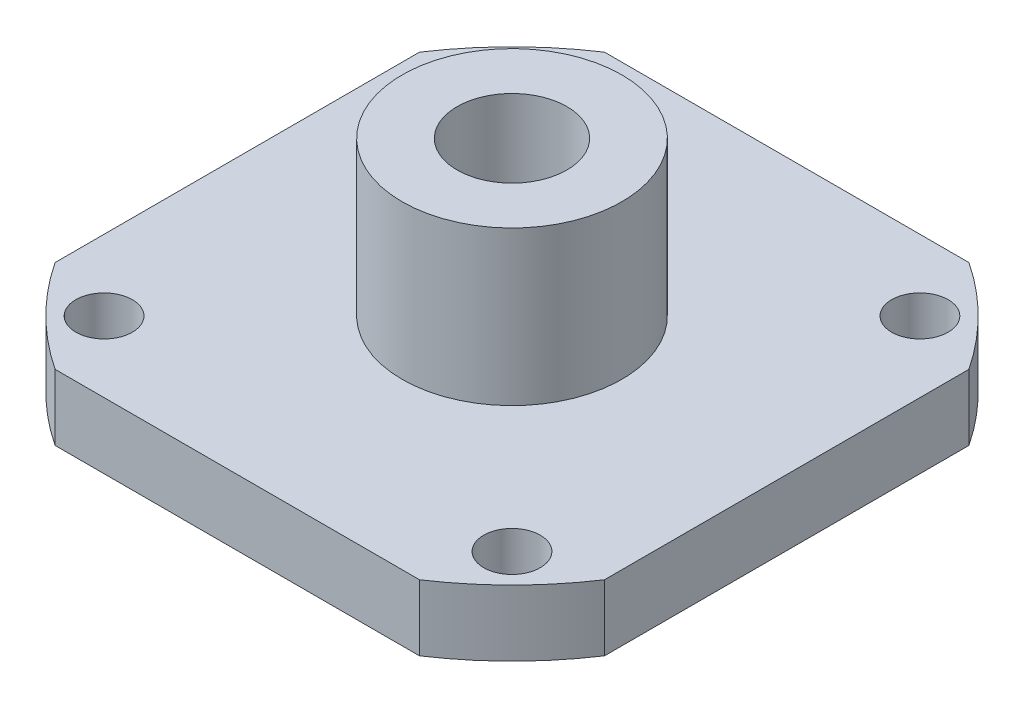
ISO-10303-21;
HEADER;
FILE_DESCRIPTION(('STEP AP214'),'2;1');
FILE_NAME('part.step','',(''),(''),'','','');
FILE_SCHEMA(('AUTOMOTIVE_DESIGN { 1 0 10303 214 1 1 1 1 }'));
ENDSEC;
DATA;
#1=APPLICATION_CONTEXT('core data for automotive mechanical design processes');
#2=APPLICATION_PROTOCOL_DEFINITION('international standard','automotive_design',2000,#1);
#3=PRODUCT_CONTEXT('',#1,'mechanical');
#4=PRODUCT('Part','Part','',(#3));
#5=PRODUCT_RELATED_PRODUCT_CATEGORY('part','',(#4));
#6=PRODUCT_DEFINITION_FORMATION('','',#4);
#7=PRODUCT_DEFINITION_CONTEXT('part definition',#1,'design');
#8=PRODUCT_DEFINITION('design','',#6,#7);
#9=PRODUCT_DEFINITION_SHAPE('','',#8);
#10=(LENGTH_UNIT() NAMED_UNIT(*) SI_UNIT(.MILLI.,.METRE.));
#11=(NAMED_UNIT(*) PLANE_ANGLE_UNIT() SI_UNIT($,.RADIAN.));
#12=(NAMED_UNIT(*) SI_UNIT($,.STERADIAN.) SOLID_ANGLE_UNIT());
#13=UNCERTAINTY_MEASURE_WITH_UNIT(LENGTH_MEASURE(1.E-05),#10,'distance_accuracy_value','');
#14=(GEOMETRIC_REPRESENTATION_CONTEXT(3) GLOBAL_UNCERTAINTY_ASSIGNED_CONTEXT((#13)) GLOBAL_UNIT_ASSIGNED_CONTEXT((#10,
#11,#12)) REPRESENTATION_CONTEXT('',''));
#15=CARTESIAN_POINT('',(0.,0.,0.));
#16=DIRECTION('',(0.,0.,1.));
#17=DIRECTION('',(1.,0.,0.));
#18=AXIS2_PLACEMENT_3D('',#15,#16,#17);
#19=CARTESIAN_POINT('',(-6.35,3.81,0.));
#20=DIRECTION('',(0.,-1.,0.));
#21=DIRECTION('',(0.,0.,-1.));
#22=AXIS2_PLACEMENT_3D('',#19,#20,#21);
#23=PLANE('',#22);
#24=CARTESIAN_POINT('',(-11.7865861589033,3.81,-11.7865861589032));
#25=DIRECTION('',(0.,1.,0.));
#26=DIRECTION('',(0.,0.,1.));
#27=AXIS2_PLACEMENT_3D('',#24,#25,#26);
#28=CIRCLE('',#27,1.63195);
#29=CARTESIAN_POINT('',(-11.7865861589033,3.81,-10.1546361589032));
#30=VERTEX_POINT('',#29);
#31=EDGE_CURVE('E185',#30,#30,#28,.T.);
#32=ORIENTED_EDGE('',*,*,#31,.F.);
#33=EDGE_LOOP('',(#32));
#34=FACE_BOUND('',#33,.T.);
#35=CARTESIAN_POINT('',(-11.7865861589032,3.81,11.7865861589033));
#36=DIRECTION('',(0.,1.,0.));
#37=DIRECTION('',(0.,0.,1.));
#38=AXIS2_PLACEMENT_3D('',#35,#36,#37);
#39=CIRCLE('',#38,1.63195);
#40=CARTESIAN_POINT('',(-11.7865861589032,3.81,13.4185361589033));
#41=VERTEX_POINT('',#40);
#42=EDGE_CURVE('E191',#41,#41,#39,.T.);
#43=ORIENTED_EDGE('',*,*,#42,.F.);
#44=EDGE_LOOP('',(#43));
#45=FACE_BOUND('',#44,.T.);
#46=CARTESIAN_POINT('',(11.7865861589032,3.81,11.7865861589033));
#47=DIRECTION('',(0.,1.,0.));
#48=DIRECTION('',(0.,0.,1.));
#49=AXIS2_PLACEMENT_3D('',#46,#47,#48);
#50=CIRCLE('',#49,1.63195);
#51=CARTESIAN_POINT('',(11.7865861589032,3.81,13.4185361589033));
#52=VERTEX_POINT('',#51);
#53=EDGE_CURVE('E197',#52,#52,#50,.T.);
#54=ORIENTED_EDGE('',*,*,#53,.F.);
#55=EDGE_LOOP('',(#54));
#56=FACE_BOUND('',#55,.T.);
#57=CARTESIAN_POINT('',(11.7865861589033,3.81,-11.7865861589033));
#58=DIRECTION('',(0.,1.,0.));
#59=DIRECTION('',(0.,0.,1.));
#60=AXIS2_PLACEMENT_3D('',#57,#58,#59);
#61=CIRCLE('',#60,1.63195);
#62=CARTESIAN_POINT('',(11.7865861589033,3.81,-10.1546361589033));
#63=VERTEX_POINT('',#62);
#64=EDGE_CURVE('E203',#63,#63,#61,.T.);
#65=ORIENTED_EDGE('',*,*,#64,.F.);
#66=EDGE_LOOP('',(#65));
#67=FACE_BOUND('',#66,.T.);
#68=CARTESIAN_POINT('',(0.,3.81,0.));
#69=DIRECTION('',(0.,-1.,0.));
#70=DIRECTION('',(0.,0.,-1.));
#71=AXIS2_PLACEMENT_3D('',#68,#69,#70);
#72=CIRCLE('',#71,6.35);
#73=CARTESIAN_POINT('',(0.,3.81,-6.35));
#74=VERTEX_POINT('',#73);
#75=EDGE_CURVE('E126',#74,#74,#72,.T.);
#76=ORIENTED_EDGE('',*,*,#75,.T.);
#77=EDGE_LOOP('',(#76));
#78=FACE_BOUND('',#77,.T.);
#79=DIRECTION('',(0.,0.,1.));
#80=VECTOR('',#79,1.);
#81=CARTESIAN_POINT('',(-15.875,3.81,-15.875));
#82=LINE('',#81,#80);
#83=CARTESIAN_POINT('',(-15.875,3.81,-10.5302837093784));
#84=VERTEX_POINT('',#83);
#85=CARTESIAN_POINT('',(-15.875,3.81,10.5302837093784));
#86=VERTEX_POINT('',#85);
#87=EDGE_CURVE('E103',#84,#86,#82,.T.);
#88=ORIENTED_EDGE('',*,*,#87,.T.);
#89=CARTESIAN_POINT('',(0.,3.81,0.));
#90=DIRECTION('',(0.,-1.,0.));
#91=DIRECTION('',(0.,0.,-1.));
#92=AXIS2_PLACEMENT_3D('',#89,#90,#91);
#93=CIRCLE('',#92,19.05);
#94=CARTESIAN_POINT('',(-10.5302837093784,3.81,15.875));
#95=VERTEX_POINT('',#94);
#96=EDGE_CURVE('E110',#95,#86,#93,.T.);
#97=ORIENTED_EDGE('',*,*,#96,.F.);
#98=DIRECTION('',(1.,0.,0.));
#99=VECTOR('',#98,1.);
#100=CARTESIAN_POINT('',(-15.875,3.81,15.875));
#101=LINE('',#100,#99);
#102=CARTESIAN_POINT('',(10.5302837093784,3.81,15.875));
#103=VERTEX_POINT('',#102);
#104=EDGE_CURVE('E94',#95,#103,#101,.T.);
#105=ORIENTED_EDGE('',*,*,#104,.T.);
#106=CARTESIAN_POINT('',(15.875,3.81,10.5302837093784));
#107=VERTEX_POINT('',#106);
#108=EDGE_CURVE('E117',#107,#103,#93,.T.);
#109=ORIENTED_EDGE('',*,*,#108,.F.);
#110=DIRECTION('',(0.,0.,-1.));
#111=VECTOR('',#110,1.);
#112=CARTESIAN_POINT('',(15.875,3.81,-15.875));
#113=LINE('',#112,#111);
#114=CARTESIAN_POINT('',(15.875,3.81,-10.5302837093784));
#115=VERTEX_POINT('',#114);
#116=EDGE_CURVE('E102',#107,#115,#113,.T.);
#117=ORIENTED_EDGE('',*,*,#116,.T.);
#118=CARTESIAN_POINT('',(10.5302837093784,3.81,-15.875));
#119=VERTEX_POINT('',#118);
#120=EDGE_CURVE('E120',#119,#115,#93,.T.);
#121=ORIENTED_EDGE('',*,*,#120,.F.);
#122=DIRECTION('',(-1.,0.,0.));
#123=VECTOR('',#122,1.);
#124=CARTESIAN_POINT('',(-15.875,3.81,-15.875));
#125=LINE('',#124,#123);
#126=CARTESIAN_POINT('',(-10.5302837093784,3.81,-15.875));
#127=VERTEX_POINT('',#126);
#128=EDGE_CURVE('E171',#119,#127,#125,.T.);
#129=ORIENTED_EDGE('',*,*,#128,.T.);
#130=EDGE_CURVE('E118',#84,#127,#93,.T.);
#131=ORIENTED_EDGE('',*,*,#130,.F.);
#132=EDGE_LOOP('',(#88,#97,#105,#109,#117,#121,#129,#131));
#133=FACE_BOUND('',#132,.T.);
#134=ADVANCED_FACE('F32',(#34,#45,#56,#67,#78,#133),#23,.F.);
#135=CARTESIAN_POINT('',(0.,0.,0.));
#136=DIRECTION('',(0.,-1.,0.));
#137=DIRECTION('',(0.,0.,-1.));
#138=AXIS2_PLACEMENT_3D('',#135,#136,#137);
#139=CYLINDRICAL_SURFACE('',#138,19.05);
#140=DIRECTION('',(0.,-1.,0.));
#141=VECTOR('',#140,1.);
#142=CARTESIAN_POINT('',(-15.875,0.,-10.5302837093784));
#143=LINE('',#142,#141);
#144=CARTESIAN_POINT('',(-15.875,0.,-10.5302837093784));
#145=VERTEX_POINT('',#144);
#146=EDGE_CURVE('E46',#84,#145,#143,.T.);
#147=ORIENTED_EDGE('',*,*,#146,.F.);
#148=ORIENTED_EDGE('',*,*,#130,.T.);
#149=DIRECTION('',(0.,-1.,0.));
#150=VECTOR('',#149,1.);
#151=CARTESIAN_POINT('',(-10.5302837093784,0.,-15.875));
#152=LINE('',#151,#150);
#153=CARTESIAN_POINT('',(-10.5302837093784,0.,-15.875));
#154=VERTEX_POINT('',#153);
#155=EDGE_CURVE('E146',#154,#127,#152,.F.);
#156=ORIENTED_EDGE('',*,*,#155,.F.);
#157=CARTESIAN_POINT('',(0.,0.,0.));
#158=DIRECTION('',(0.,-1.,0.));
#159=DIRECTION('',(0.,0.,-1.));
#160=AXIS2_PLACEMENT_3D('',#157,#158,#159);
#161=CIRCLE('',#160,19.05);
#162=EDGE_CURVE('E157',#145,#154,#161,.T.);
#163=ORIENTED_EDGE('',*,*,#162,.F.);
#164=EDGE_LOOP('',(#147,#148,#156,#163));
#165=FACE_BOUND('',#164,.T.);
#166=ADVANCED_FACE('F156',(#165),#139,.T.);
#167=DIRECTION('',(0.,-1.,0.));
#168=VECTOR('',#167,1.);
#169=CARTESIAN_POINT('',(-15.875,0.,10.5302837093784));
#170=LINE('',#169,#168);
#171=CARTESIAN_POINT('',(-15.875,0.,10.5302837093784));
#172=VERTEX_POINT('',#171);
#173=EDGE_CURVE('E179',#172,#86,#170,.F.);
#174=ORIENTED_EDGE('',*,*,#173,.F.);
#175=CARTESIAN_POINT('',(-10.5302837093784,0.,15.875));
#176=VERTEX_POINT('',#175);
#177=EDGE_CURVE('E112',#176,#172,#161,.T.);
#178=ORIENTED_EDGE('',*,*,#177,.F.);
#179=DIRECTION('',(0.,-1.,0.));
#180=VECTOR('',#179,1.);
#181=CARTESIAN_POINT('',(-10.5302837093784,0.,15.875));
#182=LINE('',#181,#180);
#183=EDGE_CURVE('E54',#95,#176,#182,.T.);
#184=ORIENTED_EDGE('',*,*,#183,.F.);
#185=ORIENTED_EDGE('',*,*,#96,.T.);
#186=EDGE_LOOP('',(#174,#178,#184,#185));
#187=FACE_BOUND('',#186,.T.);
#188=ADVANCED_FACE('F109',(#187),#139,.T.);
#189=DIRECTION('',(0.,-1.,0.));
#190=VECTOR('',#189,1.);
#191=CARTESIAN_POINT('',(10.5302837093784,0.,-15.875));
#192=LINE('',#191,#190);
#193=CARTESIAN_POINT('',(10.5302837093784,0.,-15.875));
#194=VERTEX_POINT('',#193);
#195=EDGE_CURVE('E149',#119,#194,#192,.T.);
#196=ORIENTED_EDGE('',*,*,#195,.F.);
#197=ORIENTED_EDGE('',*,*,#120,.T.);
#198=DIRECTION('',(0.,-1.,0.));
#199=VECTOR('',#198,1.);
#200=CARTESIAN_POINT('',(15.875,0.,-10.5302837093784));
#201=LINE('',#200,#199);
#202=CARTESIAN_POINT('',(15.875,0.,-10.5302837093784));
#203=VERTEX_POINT('',#202);
#204=EDGE_CURVE('E113',#203,#115,#201,.F.);
#205=ORIENTED_EDGE('',*,*,#204,.F.);
#206=EDGE_CURVE('E122',#194,#203,#161,.T.);
#207=ORIENTED_EDGE('',*,*,#206,.F.);
#208=EDGE_LOOP('',(#196,#197,#205,#207));
#209=FACE_BOUND('',#208,.T.);
#210=ADVANCED_FACE('F239',(#209),#139,.T.);
#211=DIRECTION('',(0.,-1.,0.));
#212=VECTOR('',#211,1.);
#213=CARTESIAN_POINT('',(15.875,0.,10.5302837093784));
#214=LINE('',#213,#212);
#215=CARTESIAN_POINT('',(15.875,0.,10.5302837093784));
#216=VERTEX_POINT('',#215);
#217=EDGE_CURVE('E158',#107,#216,#214,.T.);
#218=ORIENTED_EDGE('',*,*,#217,.F.);
#219=ORIENTED_EDGE('',*,*,#108,.T.);
#220=DIRECTION('',(0.,-1.,0.));
#221=VECTOR('',#220,1.);
#222=CARTESIAN_POINT('',(10.5302837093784,0.,15.875));
#223=LINE('',#222,#221);
#224=CARTESIAN_POINT('',(10.5302837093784,0.,15.875));
#225=VERTEX_POINT('',#224);
#226=EDGE_CURVE('E97',#225,#103,#223,.F.);
#227=ORIENTED_EDGE('',*,*,#226,.F.);
#228=EDGE_CURVE('E162',#216,#225,#161,.T.);
#229=ORIENTED_EDGE('',*,*,#228,.F.);
#230=EDGE_LOOP('',(#218,#219,#227,#229));
#231=FACE_BOUND('',#230,.T.);
#232=ADVANCED_FACE('F170',(#231),#139,.T.);
#233=CARTESIAN_POINT('',(-19.05,0.,0.));
#234=DIRECTION('',(0.,1.,0.));
#235=DIRECTION('',(0.,0.,1.));
#236=AXIS2_PLACEMENT_3D('',#233,#234,#235);
#237=PLANE('',#236);
#238=CARTESIAN_POINT('',(-11.7865861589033,0.,-11.7865861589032));
#239=DIRECTION('',(0.,1.,0.));
#240=DIRECTION('',(0.,0.,1.));
#241=AXIS2_PLACEMENT_3D('',#238,#239,#240);
#242=CIRCLE('',#241,1.63195);
#243=CARTESIAN_POINT('',(-11.7865861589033,0.,-10.1546361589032));
#244=VERTEX_POINT('',#243);
#245=EDGE_CURVE('E182',#244,#244,#242,.T.);
#246=ORIENTED_EDGE('',*,*,#245,.T.);
#247=EDGE_LOOP('',(#246));
#248=FACE_BOUND('',#247,.T.);
#249=CARTESIAN_POINT('',(-11.7865861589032,0.,11.7865861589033));
#250=DIRECTION('',(0.,1.,0.));
#251=DIRECTION('',(0.,0.,1.));
#252=AXIS2_PLACEMENT_3D('',#249,#250,#251);
#253=CIRCLE('',#252,1.63195);
#254=CARTESIAN_POINT('',(-11.7865861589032,0.,13.4185361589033));
#255=VERTEX_POINT('',#254);
#256=EDGE_CURVE('E188',#255,#255,#253,.T.);
#257=ORIENTED_EDGE('',*,*,#256,.T.);
#258=EDGE_LOOP('',(#257));
#259=FACE_BOUND('',#258,.T.);
#260=CARTESIAN_POINT('',(11.7865861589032,0.,11.7865861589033));
#261=DIRECTION('',(0.,1.,0.));
#262=DIRECTION('',(0.,0.,1.));
#263=AXIS2_PLACEMENT_3D('',#260,#261,#262);
#264=CIRCLE('',#263,1.63195);
#265=CARTESIAN_POINT('',(11.7865861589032,0.,13.4185361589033));
#266=VERTEX_POINT('',#265);
#267=EDGE_CURVE('E194',#266,#266,#264,.T.);
#268=ORIENTED_EDGE('',*,*,#267,.T.);
#269=EDGE_LOOP('',(#268));
#270=FACE_BOUND('',#269,.T.);
#271=CARTESIAN_POINT('',(11.7865861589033,0.,-11.7865861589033));
#272=DIRECTION('',(0.,1.,0.));
#273=DIRECTION('',(0.,0.,1.));
#274=AXIS2_PLACEMENT_3D('',#271,#272,#273);
#275=CIRCLE('',#274,1.63195);
#276=CARTESIAN_POINT('',(11.7865861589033,0.,-10.1546361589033));
#277=VERTEX_POINT('',#276);
#278=EDGE_CURVE('E200',#277,#277,#275,.T.);
#279=ORIENTED_EDGE('',*,*,#278,.T.);
#280=EDGE_LOOP('',(#279));
#281=FACE_BOUND('',#280,.T.);
#282=CARTESIAN_POINT('',(0.,0.,0.));
#283=DIRECTION('',(0.,-1.,0.));
#284=DIRECTION('',(0.,0.,-1.));
#285=AXIS2_PLACEMENT_3D('',#282,#283,#284);
#286=CIRCLE('',#285,13.442610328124);
#287=CARTESIAN_POINT('',(0.,0.,-13.442610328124));
#288=VERTEX_POINT('',#287);
#289=EDGE_CURVE('E161',#288,#288,#286,.T.);
#290=ORIENTED_EDGE('',*,*,#289,.F.);
#291=EDGE_LOOP('',(#290));
#292=FACE_BOUND('',#291,.T.);
#293=DIRECTION('',(0.,0.,1.));
#294=VECTOR('',#293,1.);
#295=CARTESIAN_POINT('',(-15.875,0.,0.));
#296=LINE('',#295,#294);
#297=EDGE_CURVE('E12',#145,#172,#296,.T.);
#298=ORIENTED_EDGE('',*,*,#297,.F.);
#299=ORIENTED_EDGE('',*,*,#162,.T.);
#300=DIRECTION('',(-1.,0.,0.));
#301=VECTOR('',#300,1.);
#302=CARTESIAN_POINT('',(-19.05,0.,-15.875));
#303=LINE('',#302,#301);
#304=EDGE_CURVE('E40',#194,#154,#303,.T.);
#305=ORIENTED_EDGE('',*,*,#304,.F.);
#306=ORIENTED_EDGE('',*,*,#206,.T.);
#307=DIRECTION('',(0.,0.,-1.));
#308=VECTOR('',#307,1.);
#309=CARTESIAN_POINT('',(15.875,0.,0.));
#310=LINE('',#309,#308);
#311=EDGE_CURVE('E141',#216,#203,#310,.T.);
#312=ORIENTED_EDGE('',*,*,#311,.F.);
#313=ORIENTED_EDGE('',*,*,#228,.T.);
#314=DIRECTION('',(1.,0.,0.));
#315=VECTOR('',#314,1.);
#316=CARTESIAN_POINT('',(-19.05,0.,15.875));
#317=LINE('',#316,#315);
#318=EDGE_CURVE('E139',#176,#225,#317,.T.);
#319=ORIENTED_EDGE('',*,*,#318,.F.);
#320=ORIENTED_EDGE('',*,*,#177,.T.);
#321=EDGE_LOOP('',(#298,#299,#305,#306,#312,#313,#319,#320));
#322=FACE_BOUND('',#321,.T.);
#323=ADVANCED_FACE('F160',(#248,#259,#270,#281,#292,#322),#237,.F.);
#324=CARTESIAN_POINT('',(-9.97618967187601,0.,0.));
#325=DIRECTION('',(0.,1.,0.));
#326=DIRECTION('',(0.,0.,1.));
#327=AXIS2_PLACEMENT_3D('',#324,#325,#326);
#328=PLANE('',#327);
#329=CARTESIAN_POINT('',(0.,0.,0.));
#330=DIRECTION('',(0.,-1.,0.));
#331=DIRECTION('',(0.,0.,-1.));
#332=AXIS2_PLACEMENT_3D('',#329,#330,#331);
#333=CIRCLE('',#332,3.175);
#334=CARTESIAN_POINT('',(0.,0.,-3.175));
#335=VERTEX_POINT('',#334);
#336=EDGE_CURVE('E136',#335,#335,#333,.T.);
#337=ORIENTED_EDGE('',*,*,#336,.F.);
#338=EDGE_LOOP('',(#337));
#339=FACE_BOUND('',#338,.T.);
#340=CARTESIAN_POINT('',(0.,0.,0.));
#341=DIRECTION('',(0.,-1.,0.));
#342=DIRECTION('',(0.,0.,-1.));
#343=AXIS2_PLACEMENT_3D('',#340,#341,#342);
#344=CIRCLE('',#343,9.97618967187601);
#345=CARTESIAN_POINT('',(0.,0.,-9.97618967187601));
#346=VERTEX_POINT('',#345);
#347=EDGE_CURVE('E206',#346,#346,#344,.T.);
#348=ORIENTED_EDGE('',*,*,#347,.T.);
#349=EDGE_LOOP('',(#348));
#350=FACE_BOUND('',#349,.T.);
#351=ADVANCED_FACE('F34',(#339,#350),#328,.F.);
#352=CARTESIAN_POINT('',(0.,0.,0.));
#353=DIRECTION('',(0.,-1.,0.));
#354=DIRECTION('',(0.,0.,-1.));
#355=AXIS2_PLACEMENT_3D('',#352,#353,#354);
#356=CYLINDRICAL_SURFACE('',#355,3.175);
#357=CARTESIAN_POINT('',(0.,12.7,0.));
#358=DIRECTION('',(0.,-1.,0.));
#359=DIRECTION('',(0.,0.,-1.));
#360=AXIS2_PLACEMENT_3D('',#357,#358,#359);
#361=CIRCLE('',#360,3.175);
#362=CARTESIAN_POINT('',(0.,12.7,-3.175));
#363=VERTEX_POINT('',#362);
#364=EDGE_CURVE('E133',#363,#363,#361,.T.);
#365=ORIENTED_EDGE('',*,*,#364,.F.);
#366=EDGE_LOOP('',(#365));
#367=FACE_BOUND('',#366,.T.);
#368=ORIENTED_EDGE('',*,*,#336,.T.);
#369=EDGE_LOOP('',(#368));
#370=FACE_BOUND('',#369,.T.);
#371=ADVANCED_FACE('F237',(#367,#370),#356,.F.);
#372=CARTESIAN_POINT('',(-3.175,12.7,0.));
#373=DIRECTION('',(0.,-1.,0.));
#374=DIRECTION('',(0.,0.,-1.));
#375=AXIS2_PLACEMENT_3D('',#372,#373,#374);
#376=PLANE('',#375);
#377=CARTESIAN_POINT('',(0.,12.7,0.));
#378=DIRECTION('',(0.,-1.,0.));
#379=DIRECTION('',(0.,0.,-1.));
#380=AXIS2_PLACEMENT_3D('',#377,#378,#379);
#381=CIRCLE('',#380,6.35);
#382=CARTESIAN_POINT('',(0.,12.7,-6.35));
#383=VERTEX_POINT('',#382);
#384=EDGE_CURVE('E130',#383,#383,#381,.T.);
#385=ORIENTED_EDGE('',*,*,#384,.F.);
#386=EDGE_LOOP('',(#385));
#387=FACE_BOUND('',#386,.T.);
#388=ORIENTED_EDGE('',*,*,#364,.T.);
#389=EDGE_LOOP('',(#388));
#390=FACE_BOUND('',#389,.T.);
#391=ADVANCED_FACE('F253',(#387,#390),#376,.F.);
#392=CARTESIAN_POINT('',(0.,0.,0.));
#393=DIRECTION('',(0.,-1.,0.));
#394=DIRECTION('',(0.,0.,-1.));
#395=AXIS2_PLACEMENT_3D('',#392,#393,#394);
#396=CYLINDRICAL_SURFACE('',#395,6.35);
#397=ORIENTED_EDGE('',*,*,#75,.F.);
#398=EDGE_LOOP('',(#397));
#399=FACE_BOUND('',#398,.T.);
#400=ORIENTED_EDGE('',*,*,#384,.T.);
#401=EDGE_LOOP('',(#400));
#402=FACE_BOUND('',#401,.T.);
#403=ADVANCED_FACE('F226',(#399,#402),#396,.T.);
#404=CARTESIAN_POINT('',(0.,0.,0.));
#405=DIRECTION('',(0.,-1.,0.));
#406=DIRECTION('',(0.,0.,-1.));
#407=AXIS2_PLACEMENT_3D('',#404,#405,#406);
#408=CONICAL_SURFACE('',#407,13.442610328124,0.0872664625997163);
#409=CARTESIAN_POINT('',(0.,1.83986877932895,0.));
#410=DIRECTION('',(0.,-1.,0.));
#411=DIRECTION('',(0.,0.,-1.));
#412=AXIS2_PLACEMENT_3D('',#409,#410,#411);
#413=CIRCLE('',#412,13.2816426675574);
#414=CARTESIAN_POINT('',(0.,1.83986877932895,-13.2816426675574));
#415=VERTEX_POINT('',#414);
#416=EDGE_CURVE('E164',#415,#415,#413,.T.);
#417=ORIENTED_EDGE('',*,*,#416,.F.);
#418=EDGE_LOOP('',(#417));
#419=FACE_BOUND('',#418,.T.);
#420=ORIENTED_EDGE('',*,*,#289,.T.);
#421=EDGE_LOOP('',(#420));
#422=FACE_BOUND('',#421,.T.);
#423=ADVANCED_FACE('F223',(#419,#422),#408,.F.);
#424=CARTESIAN_POINT('',(0.,1.8288,0.));
#425=DIRECTION('',(0.,-1.,0.));
#426=DIRECTION('',(0.,0.,-1.));
#427=AXIS2_PLACEMENT_3D('',#424,#425,#426);
#428=TOROIDAL_SURFACE('',#427,13.1551259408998,0.127);
#429=CARTESIAN_POINT('',(0.,1.9558,0.));
#430=DIRECTION('',(0.,-1.,0.));
#431=DIRECTION('',(0.,0.,-1.));
#432=AXIS2_PLACEMENT_3D('',#429,#430,#431);
#433=CIRCLE('',#432,13.1551259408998);
#434=CARTESIAN_POINT('',(0.,1.9558,-13.1551259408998));
#435=VERTEX_POINT('',#434);
#436=EDGE_CURVE('E215',#435,#435,#433,.T.);
#437=ORIENTED_EDGE('',*,*,#436,.F.);
#438=EDGE_LOOP('',(#437));
#439=FACE_BOUND('',#438,.T.);
#440=ORIENTED_EDGE('',*,*,#416,.T.);
#441=EDGE_LOOP('',(#440));
#442=FACE_BOUND('',#441,.T.);
#443=ADVANCED_FACE('F221',(#439,#442),#428,.F.);
#444=CARTESIAN_POINT('',(-10.2636740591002,1.9558,0.));
#445=DIRECTION('',(0.,1.,0.));
#446=DIRECTION('',(0.,0.,1.));
#447=AXIS2_PLACEMENT_3D('',#444,#445,#446);
#448=PLANE('',#447);
#449=CARTESIAN_POINT('',(0.,1.9558,0.));
#450=DIRECTION('',(0.,-1.,0.));
#451=DIRECTION('',(0.,0.,-1.));
#452=AXIS2_PLACEMENT_3D('',#449,#450,#451);
#453=CIRCLE('',#452,10.2636740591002);
#454=CARTESIAN_POINT('',(0.,1.9558,-10.2636740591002));
#455=VERTEX_POINT('',#454);
#456=EDGE_CURVE('E212',#455,#455,#453,.T.);
#457=ORIENTED_EDGE('',*,*,#456,.F.);
#458=EDGE_LOOP('',(#457));
#459=FACE_BOUND('',#458,.T.);
#460=ORIENTED_EDGE('',*,*,#436,.T.);
#461=EDGE_LOOP('',(#460));
#462=FACE_BOUND('',#461,.T.);
#463=ADVANCED_FACE('F277',(#459,#462),#448,.F.);
#464=CARTESIAN_POINT('',(0.,1.8288,0.));
#465=DIRECTION('',(0.,-1.,0.));
#466=DIRECTION('',(0.,0.,-1.));
#467=AXIS2_PLACEMENT_3D('',#464,#465,#466);
#468=TOROIDAL_SURFACE('',#467,10.2636740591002,0.126999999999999);
#469=CARTESIAN_POINT('',(0.,1.83986877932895,0.));
#470=DIRECTION('',(0.,-1.,0.));
#471=DIRECTION('',(0.,0.,-1.));
#472=AXIS2_PLACEMENT_3D('',#469,#470,#471);
#473=CIRCLE('',#472,10.1371573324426);
#474=CARTESIAN_POINT('',(0.,1.83986877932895,-10.1371573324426));
#475=VERTEX_POINT('',#474);
#476=EDGE_CURVE('E209',#475,#475,#473,.T.);
#477=ORIENTED_EDGE('',*,*,#476,.F.);
#478=EDGE_LOOP('',(#477));
#479=FACE_BOUND('',#478,.T.);
#480=ORIENTED_EDGE('',*,*,#456,.T.);
#481=EDGE_LOOP('',(#480));
#482=FACE_BOUND('',#481,.T.);
#483=ADVANCED_FACE('F271',(#479,#482),#468,.F.);
#484=CARTESIAN_POINT('',(0.,1.83986877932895,0.));
#485=DIRECTION('',(0.,1.,0.));
#486=DIRECTION('',(0.,0.,1.));
#487=AXIS2_PLACEMENT_3D('',#484,#485,#486);
#488=CONICAL_SURFACE('',#487,10.1371573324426,0.0872664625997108);
#489=ORIENTED_EDGE('',*,*,#347,.F.);
#490=EDGE_LOOP('',(#489));
#491=FACE_BOUND('',#490,.T.);
#492=ORIENTED_EDGE('',*,*,#476,.T.);
#493=EDGE_LOOP('',(#492));
#494=FACE_BOUND('',#493,.T.);
#495=ADVANCED_FACE('F267',(#491,#494),#488,.T.);
#496=CARTESIAN_POINT('',(11.7865861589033,3.81,-11.7865861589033));
#497=DIRECTION('',(0.,1.,0.));
#498=DIRECTION('',(0.,0.,1.));
#499=AXIS2_PLACEMENT_3D('',#496,#497,#498);
#500=CYLINDRICAL_SURFACE('',#499,1.63195);
#501=ORIENTED_EDGE('',*,*,#278,.F.);
#502=EDGE_LOOP('',(#501));
#503=FACE_BOUND('',#502,.T.);
#504=ORIENTED_EDGE('',*,*,#64,.T.);
#505=EDGE_LOOP('',(#504));
#506=FACE_BOUND('',#505,.T.);
#507=ADVANCED_FACE('F270',(#503,#506),#500,.F.);
#508=CARTESIAN_POINT('',(11.7865861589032,3.81,11.7865861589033));
#509=DIRECTION('',(0.,1.,0.));
#510=DIRECTION('',(0.,0.,1.));
#511=AXIS2_PLACEMENT_3D('',#508,#509,#510);
#512=CYLINDRICAL_SURFACE('',#511,1.63195);
#513=ORIENTED_EDGE('',*,*,#267,.F.);
#514=EDGE_LOOP('',(#513));
#515=FACE_BOUND('',#514,.T.);
#516=ORIENTED_EDGE('',*,*,#53,.T.);
#517=EDGE_LOOP('',(#516));
#518=FACE_BOUND('',#517,.T.);
#519=ADVANCED_FACE('F293',(#515,#518),#512,.F.);
#520=CARTESIAN_POINT('',(-11.7865861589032,3.81,11.7865861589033));
#521=DIRECTION('',(0.,1.,0.));
#522=DIRECTION('',(0.,0.,1.));
#523=AXIS2_PLACEMENT_3D('',#520,#521,#522);
#524=CYLINDRICAL_SURFACE('',#523,1.63195);
#525=ORIENTED_EDGE('',*,*,#256,.F.);
#526=EDGE_LOOP('',(#525));
#527=FACE_BOUND('',#526,.T.);
#528=ORIENTED_EDGE('',*,*,#42,.T.);
#529=EDGE_LOOP('',(#528));
#530=FACE_BOUND('',#529,.T.);
#531=ADVANCED_FACE('F297',(#527,#530),#524,.F.);
#532=CARTESIAN_POINT('',(-11.7865861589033,3.81,-11.7865861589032));
#533=DIRECTION('',(0.,1.,0.));
#534=DIRECTION('',(0.,0.,1.));
#535=AXIS2_PLACEMENT_3D('',#532,#533,#534);
#536=CYLINDRICAL_SURFACE('',#535,1.63195);
#537=ORIENTED_EDGE('',*,*,#245,.F.);
#538=EDGE_LOOP('',(#537));
#539=FACE_BOUND('',#538,.T.);
#540=ORIENTED_EDGE('',*,*,#31,.T.);
#541=EDGE_LOOP('',(#540));
#542=FACE_BOUND('',#541,.T.);
#543=ADVANCED_FACE('F301',(#539,#542),#536,.F.);
#544=CARTESIAN_POINT('',(-15.875,0.,15.875));
#545=DIRECTION('',(0.,0.,1.));
#546=DIRECTION('',(1.,0.,0.));
#547=AXIS2_PLACEMENT_3D('',#544,#545,#546);
#548=PLANE('',#547);
#549=ORIENTED_EDGE('',*,*,#183,.T.);
#550=ORIENTED_EDGE('',*,*,#318,.T.);
#551=ORIENTED_EDGE('',*,*,#226,.T.);
#552=ORIENTED_EDGE('',*,*,#104,.F.);
#553=EDGE_LOOP('',(#549,#550,#551,#552));
#554=FACE_BOUND('',#553,.T.);
#555=ADVANCED_FACE('F95',(#554),#548,.T.);
#556=CARTESIAN_POINT('',(15.875,0.,-15.875));
#557=DIRECTION('',(1.,0.,0.));
#558=DIRECTION('',(0.,0.,-1.));
#559=AXIS2_PLACEMENT_3D('',#556,#557,#558);
#560=PLANE('',#559);
#561=ORIENTED_EDGE('',*,*,#217,.T.);
#562=ORIENTED_EDGE('',*,*,#311,.T.);
#563=ORIENTED_EDGE('',*,*,#204,.T.);
#564=ORIENTED_EDGE('',*,*,#116,.F.);
#565=EDGE_LOOP('',(#561,#562,#563,#564));
#566=FACE_BOUND('',#565,.T.);
#567=ADVANCED_FACE('F311',(#566),#560,.T.);
#568=CARTESIAN_POINT('',(-15.875,0.,-15.875));
#569=DIRECTION('',(0.,0.,-1.));
#570=DIRECTION('',(-1.,0.,0.));
#571=AXIS2_PLACEMENT_3D('',#568,#569,#570);
#572=PLANE('',#571);
#573=ORIENTED_EDGE('',*,*,#195,.T.);
#574=ORIENTED_EDGE('',*,*,#304,.T.);
#575=ORIENTED_EDGE('',*,*,#155,.T.);
#576=ORIENTED_EDGE('',*,*,#128,.F.);
#577=EDGE_LOOP('',(#573,#574,#575,#576));
#578=FACE_BOUND('',#577,.T.);
#579=ADVANCED_FACE('F145',(#578),#572,.T.);
#580=CARTESIAN_POINT('',(-15.875,0.,-15.875));
#581=DIRECTION('',(-1.,0.,0.));
#582=DIRECTION('',(0.,0.,1.));
#583=AXIS2_PLACEMENT_3D('',#580,#581,#582);
#584=PLANE('',#583);
#585=ORIENTED_EDGE('',*,*,#146,.T.);
#586=ORIENTED_EDGE('',*,*,#297,.T.);
#587=ORIENTED_EDGE('',*,*,#173,.T.);
#588=ORIENTED_EDGE('',*,*,#87,.F.);
#589=EDGE_LOOP('',(#585,#586,#587,#588));
#590=FACE_BOUND('',#589,.T.);
#591=ADVANCED_FACE('F306',(#590),#584,.T.);
#592=CLOSED_SHELL('',(#134,#166,#188,#210,#232,#323,#351,#371,#391,#403,#423,#443,#463,#483,
#495,#507,#519,#531,#543,#555,#567,#579,#591));
#593=MANIFOLD_SOLID_BREP('B2',#592);
#594=ADVANCED_BREP_SHAPE_REPRESENTATION('',(#18,#593),#14);
#595=SHAPE_DEFINITION_REPRESENTATION(#9,#594);
ENDSEC;
END-ISO-10303-21;
